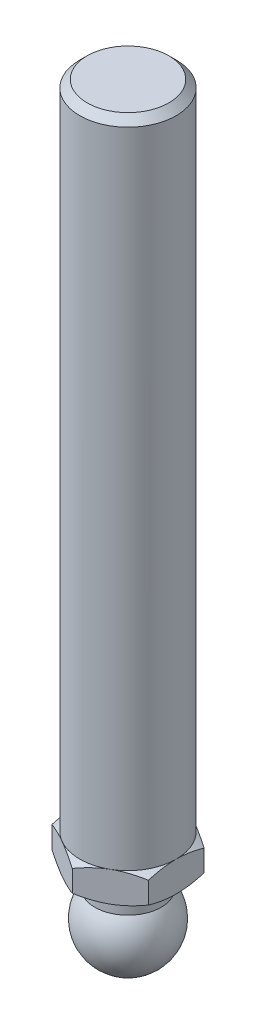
ISO-10303-21;
HEADER;
FILE_DESCRIPTION(('STEP AP214'),'2;1');
FILE_NAME('part.step','',(''),(''),'','','');
FILE_SCHEMA(('AUTOMOTIVE_DESIGN { 1 0 10303 214 1 1 1 1 }'));
ENDSEC;
DATA;
#1=APPLICATION_CONTEXT('core data for automotive mechanical design processes');
#2=APPLICATION_PROTOCOL_DEFINITION('international standard','automotive_design',2000,#1);
#3=PRODUCT_CONTEXT('',#1,'mechanical');
#4=PRODUCT('Part','Part','',(#3));
#5=PRODUCT_RELATED_PRODUCT_CATEGORY('part','',(#4));
#6=PRODUCT_DEFINITION_FORMATION('','',#4);
#7=PRODUCT_DEFINITION_CONTEXT('part definition',#1,'design');
#8=PRODUCT_DEFINITION('design','',#6,#7);
#9=PRODUCT_DEFINITION_SHAPE('','',#8);
#10=(LENGTH_UNIT() NAMED_UNIT(*) SI_UNIT(.MILLI.,.METRE.));
#11=(NAMED_UNIT(*) PLANE_ANGLE_UNIT() SI_UNIT($,.RADIAN.));
#12=(NAMED_UNIT(*) SI_UNIT($,.STERADIAN.) SOLID_ANGLE_UNIT());
#13=UNCERTAINTY_MEASURE_WITH_UNIT(LENGTH_MEASURE(1.E-05),#10,'distance_accuracy_value','');
#14=(GEOMETRIC_REPRESENTATION_CONTEXT(3) GLOBAL_UNCERTAINTY_ASSIGNED_CONTEXT((#13)) GLOBAL_UNIT_ASSIGNED_CONTEXT((#10,
#11,#12)) REPRESENTATION_CONTEXT('',''));
#15=CARTESIAN_POINT('',(0.,0.,0.));
#16=DIRECTION('',(0.,0.,1.));
#17=DIRECTION('',(1.,0.,0.));
#18=AXIS2_PLACEMENT_3D('',#15,#16,#17);
#19=CARTESIAN_POINT('',(0.,7.,0.));
#20=DIRECTION('',(0.,-1.,0.));
#21=DIRECTION('',(-1.,0.,0.));
#22=AXIS2_PLACEMENT_3D('',#19,#20,#21);
#23=SPHERICAL_SURFACE('',#22,7.);
#24=CARTESIAN_POINT('',(-9.71445146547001E-13,0.,0.));
#25=VERTEX_POINT('',#24);
#26=VERTEX_LOOP('',#25);
#27=FACE_BOUND('',#26,.T.);
#28=CARTESIAN_POINT('',(0.,11.3301270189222,0.));
#29=DIRECTION('',(0.,-1.,0.));
#30=DIRECTION('',(0.,0.,-1.));
#31=AXIS2_PLACEMENT_3D('',#28,#29,#30);
#32=CIRCLE('',#31,5.5);
#33=CARTESIAN_POINT('',(0.,11.3301270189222,-5.5));
#34=VERTEX_POINT('',#33);
#35=EDGE_CURVE('E9',#34,#34,#32,.T.);
#36=ORIENTED_EDGE('',*,*,#35,.T.);
#37=EDGE_LOOP('',(#36));
#38=FACE_BOUND('',#37,.T.);
#39=ADVANCED_FACE('F14',(#27,#38),#23,.T.);
#40=CARTESIAN_POINT('',(0.,0.,0.));
#41=DIRECTION('',(0.,-1.,0.));
#42=DIRECTION('',(0.,0.,-1.));
#43=AXIS2_PLACEMENT_3D('',#40,#41,#42);
#44=CYLINDRICAL_SURFACE('',#43,5.5);
#45=ORIENTED_EDGE('',*,*,#35,.F.);
#46=EDGE_LOOP('',(#45));
#47=FACE_BOUND('',#46,.T.);
#48=CARTESIAN_POINT('',(0.,14.5,0.));
#49=DIRECTION('',(0.,-1.,0.));
#50=DIRECTION('',(0.,0.,-1.));
#51=AXIS2_PLACEMENT_3D('',#48,#49,#50);
#52=CIRCLE('',#51,5.5);
#53=CARTESIAN_POINT('',(0.,14.5,-5.5));
#54=VERTEX_POINT('',#53);
#55=EDGE_CURVE('E146',#54,#54,#52,.T.);
#56=ORIENTED_EDGE('',*,*,#55,.T.);
#57=EDGE_LOOP('',(#56));
#58=FACE_BOUND('',#57,.T.);
#59=ADVANCED_FACE('F251',(#47,#58),#44,.T.);
#60=CARTESIAN_POINT('',(8.,14.5,0.));
#61=DIRECTION('',(0.,1.,0.));
#62=DIRECTION('',(0.,0.,1.));
#63=AXIS2_PLACEMENT_3D('',#60,#61,#62);
#64=PLANE('',#63);
#65=ORIENTED_EDGE('',*,*,#55,.F.);
#66=EDGE_LOOP('',(#65));
#67=FACE_BOUND('',#66,.T.);
#68=CARTESIAN_POINT('',(0.,14.5,0.));
#69=DIRECTION('',(0.,-1.,0.));
#70=DIRECTION('',(0.,0.,-1.));
#71=AXIS2_PLACEMENT_3D('',#68,#69,#70);
#72=CIRCLE('',#71,8.);
#73=CARTESIAN_POINT('',(4.,14.5,-6.92820323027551));
#74=VERTEX_POINT('',#73);
#75=CARTESIAN_POINT('',(8.,14.5,0.));
#76=VERTEX_POINT('',#75);
#77=EDGE_CURVE('E145',#74,#76,#72,.T.);
#78=ORIENTED_EDGE('',*,*,#77,.T.);
#79=CARTESIAN_POINT('',(4.,14.5,6.92820323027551));
#80=VERTEX_POINT('',#79);
#81=EDGE_CURVE('E141',#76,#80,#72,.T.);
#82=ORIENTED_EDGE('',*,*,#81,.T.);
#83=CARTESIAN_POINT('',(-4.,14.5,6.92820323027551));
#84=VERTEX_POINT('',#83);
#85=EDGE_CURVE('E144',#80,#84,#72,.T.);
#86=ORIENTED_EDGE('',*,*,#85,.T.);
#87=CARTESIAN_POINT('',(-8.,14.5,0.));
#88=VERTEX_POINT('',#87);
#89=EDGE_CURVE('E212',#84,#88,#72,.T.);
#90=ORIENTED_EDGE('',*,*,#89,.T.);
#91=CARTESIAN_POINT('',(-4.,14.5,-6.92820323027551));
#92=VERTEX_POINT('',#91);
#93=EDGE_CURVE('E215',#88,#92,#72,.T.);
#94=ORIENTED_EDGE('',*,*,#93,.T.);
#95=EDGE_CURVE('E220',#92,#74,#72,.T.);
#96=ORIENTED_EDGE('',*,*,#95,.T.);
#97=EDGE_LOOP('',(#78,#82,#86,#90,#94,#96));
#98=FACE_BOUND('',#97,.T.);
#99=ADVANCED_FACE('F222',(#67,#98),#64,.F.);
#100=CARTESIAN_POINT('',(0.,17.,0.));
#101=DIRECTION('',(0.,1.,0.));
#102=DIRECTION('',(0.,0.,1.));
#103=AXIS2_PLACEMENT_3D('',#100,#101,#102);
#104=CONICAL_SURFACE('',#103,12.3301270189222,1.0471975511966);
#105=CARTESIAN_POINT('',(-8.,19.285548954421,-14.1889203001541));
#106=CARTESIAN_POINT('',(-8.,19.1157216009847,-13.851186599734));
#107=CARTESIAN_POINT('',(-8.,18.9470198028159,-13.5128811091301));
#108=CARTESIAN_POINT('',(-8.,18.6124136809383,-12.8348638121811));
#109=CARTESIAN_POINT('',(-8.,18.446509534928,-12.4951519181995));
#110=CARTESIAN_POINT('',(-8.,18.1177477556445,-11.8134403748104));
#111=CARTESIAN_POINT('',(-8.,17.9548966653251,-11.4714375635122));
#112=CARTESIAN_POINT('',(-8.,17.6333333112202,-10.7854960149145));
#113=CARTESIAN_POINT('',(-8.,17.4746209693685,-10.4415573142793));
#114=CARTESIAN_POINT('',(-8.,17.1550497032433,-9.7353527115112));
#115=CARTESIAN_POINT('',(-8.,16.9944328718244,-9.37297690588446));
#116=CARTESIAN_POINT('',(-8.,16.680226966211,-8.64516064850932));
#117=CARTESIAN_POINT('',(-8.,16.5266382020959,-8.27972006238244));
#118=CARTESIAN_POINT('',(-8.,16.2285062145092,-7.54540420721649));
#119=CARTESIAN_POINT('',(-8.,16.0839575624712,-7.17653115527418));
#120=CARTESIAN_POINT('',(-8.,15.8063691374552,-6.43449862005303));
#121=CARTESIAN_POINT('',(-8.,15.6733281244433,-6.06133960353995));
#122=CARTESIAN_POINT('',(-8.,15.394180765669,-5.22677195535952));
#123=CARTESIAN_POINT('',(-8.,15.2517108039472,-4.7641292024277));
#124=CARTESIAN_POINT('',(-8.,14.9966536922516,-3.83044032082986));
#125=CARTESIAN_POINT('',(-8.,14.884064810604,-3.35939468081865));
#126=CARTESIAN_POINT('',(-8.,14.7453718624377,-2.65118427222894));
#127=CARTESIAN_POINT('',(-8.,14.7044045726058,-2.41690742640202));
#128=CARTESIAN_POINT('',(-8.,14.6329876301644,-1.94676929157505));
#129=CARTESIAN_POINT('',(-8.,14.6025364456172,-1.7109082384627));
#130=CARTESIAN_POINT('',(-8.,14.5530553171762,-1.23805721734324));
#131=CARTESIAN_POINT('',(-8.,14.5340217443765,-1.00106763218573));
#132=CARTESIAN_POINT('',(-8.,14.5079793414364,-0.52642336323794));
#133=CARTESIAN_POINT('',(-8.,14.500970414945,-0.288768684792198));
#134=CARTESIAN_POINT('',(-8.,14.4992116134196,0.188309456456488));
#135=CARTESIAN_POINT('',(-8.,14.5045509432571,0.427733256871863));
#136=CARTESIAN_POINT('',(-8.,14.5274871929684,0.905988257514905));
#137=CARTESIAN_POINT('',(-8.,14.5450842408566,1.1448194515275));
#138=CARTESIAN_POINT('',(-8.,14.5919591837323,1.62141631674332));
#139=CARTESIAN_POINT('',(-8.,14.6212415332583,1.85918154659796));
#140=CARTESIAN_POINT('',(-8.,14.6905925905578,2.33311174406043));
#141=CARTESIAN_POINT('',(-8.,14.7306614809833,2.56927668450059));
#142=CARTESIAN_POINT('',(-8.,14.8670437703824,3.28330816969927));
#143=CARTESIAN_POINT('',(-8.,14.9786420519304,3.75830022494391));
#144=CARTESIAN_POINT('',(-8.,15.169124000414,4.46428489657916));
#145=CARTESIAN_POINT('',(-8.,15.2364734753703,4.69855285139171));
#146=CARTESIAN_POINT('',(-8.,15.3778224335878,5.16507806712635));
#147=CARTESIAN_POINT('',(-8.,15.4518216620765,5.3973354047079));
#148=CARTESIAN_POINT('',(-8.,15.654376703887,6.0070580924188));
#149=CARTESIAN_POINT('',(-8.,15.7876997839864,6.38293491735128));
#150=CARTESIAN_POINT('',(-8.,16.0661205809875,7.13030495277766));
#151=CARTESIAN_POINT('',(-8.,16.2112196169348,7.50179766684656));
#152=CARTESIAN_POINT('',(-8.,16.5106611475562,8.2412884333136));
#153=CARTESIAN_POINT('',(-8.,16.6650093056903,8.60928418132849));
#154=CARTESIAN_POINT('',(-8.,16.9808780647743,9.34215095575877));
#155=CARTESIAN_POINT('',(-8.,17.1423983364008,9.7070221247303));
#156=CARTESIAN_POINT('',(-8.,17.4637771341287,10.4179250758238));
#157=CARTESIAN_POINT('',(-8.,17.6233869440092,10.7640696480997));
#158=CARTESIAN_POINT('',(-8.,17.9468132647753,11.4543922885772));
#159=CARTESIAN_POINT('',(-8.,18.1106298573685,11.7985703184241));
#160=CARTESIAN_POINT('',(-8.,18.441361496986,12.4845836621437));
#161=CARTESIAN_POINT('',(-8.,18.6082696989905,12.8264222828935));
#162=CARTESIAN_POINT('',(-8.,18.9449220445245,13.5086735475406));
#163=CARTESIAN_POINT('',(-8.,19.1146660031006,13.8490862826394));
#164=CARTESIAN_POINT('',(-8.,19.285548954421,14.1889203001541));
#165=B_SPLINE_CURVE_WITH_KNOTS('',3,(#105,#106,#107,#108,#109,#110,#111,#112,#113,#114,#115,
#116,#117,#118,#119,#120,#121,#122,#123,#124,#125,#126,#127,#128,#129,#130,#131,#132,#133,#134,
#135,#136,#137,#138,#139,#140,#141,#142,#143,#144,#145,#146,#147,#148,#149,#150,#151,#152,#153,
#154,#155,#156,#157,#158,#159,#160,#161,#162,#163,#164),.UNSPECIFIED.,.F.,.F.,(4,2,2,2,2,2,2,2,
2,2,2,2,2,2,2,2,2,2,2,2,2,2,2,2,2,2,2,2,2,4),(0.,1.13409047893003,2.2682527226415,
3.40461779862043,4.54096142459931,5.7300307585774,6.91915250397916,8.1075531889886,
9.29582565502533,10.7473798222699,12.1988498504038,12.9121466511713,13.6253394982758,
14.3383055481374,15.0512658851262,15.7693927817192,16.4875271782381,17.2059355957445,
17.9243561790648,19.3864869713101,20.1177019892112,20.8488890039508,22.0450800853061,
23.2414053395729,24.4384707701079,25.6354812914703,26.7789606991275,27.9224623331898,
29.063679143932,30.2048218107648),.UNSPECIFIED.);
#166=CARTESIAN_POINT('',(-8.,15.2145311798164,4.61880215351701));
#167=VERTEX_POINT('',#166);
#168=EDGE_CURVE('E157',#88,#167,#165,.T.);
#169=ORIENTED_EDGE('',*,*,#168,.F.);
#170=ORIENTED_EDGE('',*,*,#89,.F.);
#171=CARTESIAN_POINT('',(-8.0002,15.214597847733,4.61868668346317));
#172=CARTESIAN_POINT('',(-7.82435121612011,15.1559907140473,4.7202130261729));
#173=CARTESIAN_POINT('',(-7.64784680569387,15.1000434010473,4.82211789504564));
#174=CARTESIAN_POINT('',(-7.29340453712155,14.9942010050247,5.02675523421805));
#175=CARTESIAN_POINT('',(-7.11546609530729,14.9443085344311,5.1294880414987));
#176=CARTESIAN_POINT('',(-6.57880176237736,14.8046927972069,5.43933133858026));
#177=CARTESIAN_POINT('',(-6.21795741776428,14.7252811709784,5.64766491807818));
#178=CARTESIAN_POINT('',(-5.67796082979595,14.6321616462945,5.95943209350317));
#179=CARTESIAN_POINT('',(-5.50042181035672,14.6056345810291,6.06193429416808));
#180=CARTESIAN_POINT('',(-5.1445408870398,14.5611531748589,6.26740224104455));
#181=CARTESIAN_POINT('',(-4.96619905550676,14.5431980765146,6.37036794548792));
#182=CARTESIAN_POINT('',(-4.60920831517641,14.5163156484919,6.57647664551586));
#183=CARTESIAN_POINT('',(-4.4305599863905,14.5073780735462,6.67961930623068));
#184=CARTESIAN_POINT('',(-4.07309829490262,14.4987223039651,6.88599991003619));
#185=CARTESIAN_POINT('',(-3.89428493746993,14.4990038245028,6.98923785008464));
#186=CARTESIAN_POINT('',(-3.55998663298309,14.5081450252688,7.18224506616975));
#187=CARTESIAN_POINT('',(-3.40447809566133,14.5158896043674,7.27202796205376));
#188=CARTESIAN_POINT('',(-3.09382523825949,14.5382011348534,7.45138347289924));
#189=CARTESIAN_POINT('',(-2.93868094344,14.5527685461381,7.54095607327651));
#190=CARTESIAN_POINT('',(-2.47384868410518,14.6063606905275,7.80932710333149));
#191=CARTESIAN_POINT('',(-2.16498351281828,14.6552686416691,7.98765049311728));
#192=CARTESIAN_POINT('',(-1.5439767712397,14.7775394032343,8.34618890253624));
#193=CARTESIAN_POINT('',(-1.23191445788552,14.851420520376,8.52635816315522));
#194=CARTESIAN_POINT('',(-0.612443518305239,15.019100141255,8.88400987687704));
#195=CARTESIAN_POINT('',(-0.305026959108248,15.1128592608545,9.06149691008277));
#196=CARTESIAN_POINT('',(0.000200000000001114,15.214597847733,9.23771977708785));
#197=B_SPLINE_CURVE_WITH_KNOTS('',3,(#171,#172,#173,#174,#175,#176,#177,#178,#179,#180,#181,
#182,#183,#184,#185,#186,#187,#188,#189,#190,#191,#192,#193,#194,#195,#196),.UNSPECIFIED.,.F.,
.F.,(4,2,2,2,2,2,2,2,2,2,2,2,4),(0.,0.633973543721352,1.26821965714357,2.53934712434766,
3.1593434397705,3.77928496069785,4.39852133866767,5.01773858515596,5.5568023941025,
6.09590254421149,7.17487077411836,8.27776850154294,9.37850115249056),.UNSPECIFIED.);
#198=EDGE_CURVE('E120',#167,#84,#197,.T.);
#199=ORIENTED_EDGE('',*,*,#198,.F.);
#200=EDGE_LOOP('',(#169,#170,#199));
#201=FACE_BOUND('',#200,.T.);
#202=ADVANCED_FACE('F210',(#201),#104,.T.);
#203=CARTESIAN_POINT('',(0.0002,15.214597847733,-9.23771977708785));
#204=CARTESIAN_POINT('',(-0.175648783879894,15.1559907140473,-9.13619343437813));
#205=CARTESIAN_POINT('',(-0.352153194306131,15.1000434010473,-9.03428856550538));
#206=CARTESIAN_POINT('',(-0.706595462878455,14.9942010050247,-8.82965122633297));
#207=CARTESIAN_POINT('',(-0.884533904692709,14.9443085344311,-8.72691841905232));
#208=CARTESIAN_POINT('',(-1.42119823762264,14.8046927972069,-8.41707512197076));
#209=CARTESIAN_POINT('',(-1.78204258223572,14.7252811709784,-8.20874154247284));
#210=CARTESIAN_POINT('',(-2.32203917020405,14.6321616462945,-7.89697436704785));
#211=CARTESIAN_POINT('',(-2.49957818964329,14.6056345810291,-7.79447216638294));
#212=CARTESIAN_POINT('',(-2.8554591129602,14.5611531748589,-7.58900421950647));
#213=CARTESIAN_POINT('',(-3.03380094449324,14.5431980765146,-7.4860385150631));
#214=CARTESIAN_POINT('',(-3.39079168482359,14.5163156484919,-7.27992981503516));
#215=CARTESIAN_POINT('',(-3.5694400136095,14.5073780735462,-7.17678715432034));
#216=CARTESIAN_POINT('',(-3.92690170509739,14.4987223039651,-6.97040655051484));
#217=CARTESIAN_POINT('',(-4.10571506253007,14.4990038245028,-6.86716861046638));
#218=CARTESIAN_POINT('',(-4.44001336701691,14.5081450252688,-6.67416139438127));
#219=CARTESIAN_POINT('',(-4.59552190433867,14.5158896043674,-6.58437849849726));
#220=CARTESIAN_POINT('',(-4.90617476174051,14.5382011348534,-6.40502298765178));
#221=CARTESIAN_POINT('',(-5.06131905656,14.5527685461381,-6.31545038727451));
#222=CARTESIAN_POINT('',(-5.52615131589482,14.6063606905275,-6.04707935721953));
#223=CARTESIAN_POINT('',(-5.83501648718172,14.6552686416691,-5.86875596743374));
#224=CARTESIAN_POINT('',(-6.4560232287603,14.7775394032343,-5.51021755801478));
#225=CARTESIAN_POINT('',(-6.76808554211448,14.851420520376,-5.3300482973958));
#226=CARTESIAN_POINT('',(-7.38755648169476,15.019100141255,-4.97239658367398));
#227=CARTESIAN_POINT('',(-7.69497304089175,15.1128592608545,-4.79490955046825));
#228=CARTESIAN_POINT('',(-8.0002,15.214597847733,-4.61868668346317));
#229=B_SPLINE_CURVE_WITH_KNOTS('',3,(#203,#204,#205,#206,#207,#208,#209,#210,#211,#212,#213,
#214,#215,#216,#217,#218,#219,#220,#221,#222,#223,#224,#225,#226,#227,#228),.UNSPECIFIED.,.F.,
.F.,(4,2,2,2,2,2,2,2,2,2,2,2,4),(0.,0.633973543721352,1.26821965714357,2.53934712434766,
3.1593434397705,3.77928496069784,4.39852133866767,5.01773858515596,5.5568023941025,
6.09590254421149,7.17487077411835,8.27776850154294,9.37850115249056),.UNSPECIFIED.);
#230=CARTESIAN_POINT('',(-8.,15.2145311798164,-4.61880215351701));
#231=VERTEX_POINT('',#230);
#232=EDGE_CURVE('E182',#92,#231,#229,.T.);
#233=ORIENTED_EDGE('',*,*,#232,.F.);
#234=ORIENTED_EDGE('',*,*,#93,.F.);
#235=EDGE_CURVE('E156',#231,#88,#165,.T.);
#236=ORIENTED_EDGE('',*,*,#235,.F.);
#237=EDGE_LOOP('',(#233,#234,#236));
#238=FACE_BOUND('',#237,.T.);
#239=ADVANCED_FACE('F216',(#238),#104,.T.);
#240=CARTESIAN_POINT('',(8.0002,15.214597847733,-4.61868668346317));
#241=CARTESIAN_POINT('',(7.82435121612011,15.1559907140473,-4.7202130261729));
#242=CARTESIAN_POINT('',(7.64784680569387,15.1000434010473,-4.82211789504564));
#243=CARTESIAN_POINT('',(7.29340453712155,14.9942010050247,-5.02675523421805));
#244=CARTESIAN_POINT('',(7.11546609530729,14.9443085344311,-5.1294880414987));
#245=CARTESIAN_POINT('',(6.57880176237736,14.8046927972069,-5.43933133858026));
#246=CARTESIAN_POINT('',(6.21795741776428,14.7252811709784,-5.64766491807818));
#247=CARTESIAN_POINT('',(5.67796082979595,14.6321616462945,-5.95943209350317));
#248=CARTESIAN_POINT('',(5.50042181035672,14.6056345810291,-6.06193429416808));
#249=CARTESIAN_POINT('',(5.1445408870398,14.5611531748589,-6.26740224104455));
#250=CARTESIAN_POINT('',(4.96619905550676,14.5431980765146,-6.37036794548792));
#251=CARTESIAN_POINT('',(4.60920831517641,14.5163156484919,-6.57647664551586));
#252=CARTESIAN_POINT('',(4.4305599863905,14.5073780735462,-6.67961930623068));
#253=CARTESIAN_POINT('',(4.07309829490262,14.4987223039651,-6.88599991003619));
#254=CARTESIAN_POINT('',(3.89428493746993,14.4990038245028,-6.98923785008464));
#255=CARTESIAN_POINT('',(3.55998663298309,14.5081450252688,-7.18224506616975));
#256=CARTESIAN_POINT('',(3.40447809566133,14.5158896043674,-7.27202796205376));
#257=CARTESIAN_POINT('',(3.09382523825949,14.5382011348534,-7.45138347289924));
#258=CARTESIAN_POINT('',(2.93868094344,14.5527685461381,-7.54095607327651));
#259=CARTESIAN_POINT('',(2.47384868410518,14.6063606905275,-7.80932710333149));
#260=CARTESIAN_POINT('',(2.16498351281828,14.6552686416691,-7.98765049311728));
#261=CARTESIAN_POINT('',(1.5439767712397,14.7775394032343,-8.34618890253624));
#262=CARTESIAN_POINT('',(1.23191445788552,14.851420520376,-8.52635816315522));
#263=CARTESIAN_POINT('',(0.612443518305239,15.019100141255,-8.88400987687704));
#264=CARTESIAN_POINT('',(0.305026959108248,15.1128592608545,-9.06149691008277));
#265=CARTESIAN_POINT('',(-0.000200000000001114,15.214597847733,-9.23771977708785));
#266=B_SPLINE_CURVE_WITH_KNOTS('',3,(#240,#241,#242,#243,#244,#245,#246,#247,#248,#249,#250,
#251,#252,#253,#254,#255,#256,#257,#258,#259,#260,#261,#262,#263,#264,#265),.UNSPECIFIED.,.F.,
.F.,(4,2,2,2,2,2,2,2,2,2,2,2,4),(0.,0.633973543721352,1.26821965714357,2.53934712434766,
3.1593434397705,3.77928496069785,4.39852133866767,5.01773858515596,5.5568023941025,
6.09590254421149,7.17487077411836,8.27776850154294,9.37850115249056),.UNSPECIFIED.);
#267=CARTESIAN_POINT('',(0.,15.2145311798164,-9.23760430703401));
#268=VERTEX_POINT('',#267);
#269=EDGE_CURVE('E285',#74,#268,#266,.T.);
#270=ORIENTED_EDGE('',*,*,#269,.F.);
#271=ORIENTED_EDGE('',*,*,#95,.F.);
#272=EDGE_CURVE('E193',#268,#92,#229,.T.);
#273=ORIENTED_EDGE('',*,*,#272,.F.);
#274=EDGE_LOOP('',(#270,#271,#273));
#275=FACE_BOUND('',#274,.T.);
#276=ADVANCED_FACE('F305',(#275),#104,.T.);
#277=CARTESIAN_POINT('',(-0.0002,15.214597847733,9.23771977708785));
#278=CARTESIAN_POINT('',(0.175648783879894,15.1559907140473,9.13619343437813));
#279=CARTESIAN_POINT('',(0.352153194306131,15.1000434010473,9.03428856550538));
#280=CARTESIAN_POINT('',(0.706595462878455,14.9942010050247,8.82965122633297));
#281=CARTESIAN_POINT('',(0.884533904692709,14.9443085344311,8.72691841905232));
#282=CARTESIAN_POINT('',(1.42119823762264,14.8046927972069,8.41707512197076));
#283=CARTESIAN_POINT('',(1.78204258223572,14.7252811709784,8.20874154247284));
#284=CARTESIAN_POINT('',(2.32203917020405,14.6321616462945,7.89697436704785));
#285=CARTESIAN_POINT('',(2.49957818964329,14.6056345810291,7.79447216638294));
#286=CARTESIAN_POINT('',(2.8554591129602,14.5611531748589,7.58900421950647));
#287=CARTESIAN_POINT('',(3.03380094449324,14.5431980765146,7.4860385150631));
#288=CARTESIAN_POINT('',(3.39079168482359,14.5163156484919,7.27992981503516));
#289=CARTESIAN_POINT('',(3.5694400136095,14.5073780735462,7.17678715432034));
#290=CARTESIAN_POINT('',(3.92690170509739,14.4987223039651,6.97040655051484));
#291=CARTESIAN_POINT('',(4.10571506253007,14.4990038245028,6.86716861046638));
#292=CARTESIAN_POINT('',(4.44001336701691,14.5081450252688,6.67416139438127));
#293=CARTESIAN_POINT('',(4.59552190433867,14.5158896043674,6.58437849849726));
#294=CARTESIAN_POINT('',(4.90617476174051,14.5382011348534,6.40502298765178));
#295=CARTESIAN_POINT('',(5.06131905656,14.5527685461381,6.31545038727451));
#296=CARTESIAN_POINT('',(5.52615131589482,14.6063606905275,6.04707935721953));
#297=CARTESIAN_POINT('',(5.83501648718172,14.6552686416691,5.86875596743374));
#298=CARTESIAN_POINT('',(6.4560232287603,14.7775394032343,5.51021755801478));
#299=CARTESIAN_POINT('',(6.76808554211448,14.851420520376,5.3300482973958));
#300=CARTESIAN_POINT('',(7.38755648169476,15.019100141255,4.97239658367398));
#301=CARTESIAN_POINT('',(7.69497304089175,15.1128592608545,4.79490955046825));
#302=CARTESIAN_POINT('',(8.0002,15.214597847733,4.61868668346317));
#303=B_SPLINE_CURVE_WITH_KNOTS('',3,(#277,#278,#279,#280,#281,#282,#283,#284,#285,#286,#287,
#288,#289,#290,#291,#292,#293,#294,#295,#296,#297,#298,#299,#300,#301,#302),.UNSPECIFIED.,.F.,
.F.,(4,2,2,2,2,2,2,2,2,2,2,2,4),(0.,0.633973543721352,1.26821965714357,2.53934712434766,
3.1593434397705,3.77928496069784,4.39852133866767,5.01773858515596,5.5568023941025,
6.09590254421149,7.17487077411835,8.27776850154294,9.37850115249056),.UNSPECIFIED.);
#304=CARTESIAN_POINT('',(0.,15.2145311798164,9.23760430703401));
#305=VERTEX_POINT('',#304);
#306=EDGE_CURVE('E228',#305,#80,#303,.T.);
#307=ORIENTED_EDGE('',*,*,#306,.F.);
#308=EDGE_CURVE('E31',#84,#305,#197,.T.);
#309=ORIENTED_EDGE('',*,*,#308,.F.);
#310=ORIENTED_EDGE('',*,*,#85,.F.);
#311=EDGE_LOOP('',(#307,#309,#310));
#312=FACE_BOUND('',#311,.T.);
#313=ADVANCED_FACE('F227',(#312),#104,.T.);
#314=CARTESIAN_POINT('',(8.,15.2145311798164,-4.61880215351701));
#315=VERTEX_POINT('',#314);
#316=EDGE_CURVE('E290',#315,#74,#266,.T.);
#317=ORIENTED_EDGE('',*,*,#316,.F.);
#318=CARTESIAN_POINT('',(8.,19.285548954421,14.1889203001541));
#319=CARTESIAN_POINT('',(8.,19.1157216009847,13.851186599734));
#320=CARTESIAN_POINT('',(8.,18.9470198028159,13.5128811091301));
#321=CARTESIAN_POINT('',(8.,18.6124136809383,12.8348638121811));
#322=CARTESIAN_POINT('',(8.,18.446509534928,12.4951519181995));
#323=CARTESIAN_POINT('',(8.,18.1177477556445,11.8134403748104));
#324=CARTESIAN_POINT('',(8.,17.9548966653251,11.4714375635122));
#325=CARTESIAN_POINT('',(8.,17.6333333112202,10.7854960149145));
#326=CARTESIAN_POINT('',(8.,17.4746209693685,10.4415573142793));
#327=CARTESIAN_POINT('',(8.,17.1550497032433,9.7353527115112));
#328=CARTESIAN_POINT('',(8.,16.9944328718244,9.37297690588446));
#329=CARTESIAN_POINT('',(8.,16.680226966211,8.64516064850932));
#330=CARTESIAN_POINT('',(8.,16.5266382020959,8.27972006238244));
#331=CARTESIAN_POINT('',(8.,16.2285062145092,7.54540420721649));
#332=CARTESIAN_POINT('',(8.,16.0839575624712,7.17653115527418));
#333=CARTESIAN_POINT('',(8.,15.8063691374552,6.43449862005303));
#334=CARTESIAN_POINT('',(8.,15.6733281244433,6.06133960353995));
#335=CARTESIAN_POINT('',(8.,15.394180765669,5.22677195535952));
#336=CARTESIAN_POINT('',(8.,15.2517108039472,4.7641292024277));
#337=CARTESIAN_POINT('',(8.,14.9966536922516,3.83044032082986));
#338=CARTESIAN_POINT('',(8.,14.884064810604,3.35939468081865));
#339=CARTESIAN_POINT('',(8.,14.7453718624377,2.65118427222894));
#340=CARTESIAN_POINT('',(8.,14.7044045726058,2.41690742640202));
#341=CARTESIAN_POINT('',(8.,14.6329876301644,1.94676929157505));
#342=CARTESIAN_POINT('',(8.,14.6025364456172,1.7109082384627));
#343=CARTESIAN_POINT('',(8.,14.5530553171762,1.23805721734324));
#344=CARTESIAN_POINT('',(8.,14.5340217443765,1.00106763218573));
#345=CARTESIAN_POINT('',(8.,14.5079793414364,0.52642336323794));
#346=CARTESIAN_POINT('',(8.,14.500970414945,0.288768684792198));
#347=CARTESIAN_POINT('',(8.,14.4992116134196,-0.188309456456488));
#348=CARTESIAN_POINT('',(8.,14.5045509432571,-0.427733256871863));
#349=CARTESIAN_POINT('',(8.,14.5274871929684,-0.905988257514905));
#350=CARTESIAN_POINT('',(8.,14.5450842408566,-1.1448194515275));
#351=CARTESIAN_POINT('',(8.,14.5919591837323,-1.62141631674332));
#352=CARTESIAN_POINT('',(8.,14.6212415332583,-1.85918154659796));
#353=CARTESIAN_POINT('',(8.,14.6905925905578,-2.33311174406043));
#354=CARTESIAN_POINT('',(8.,14.7306614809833,-2.56927668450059));
#355=CARTESIAN_POINT('',(8.,14.8670437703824,-3.28330816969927));
#356=CARTESIAN_POINT('',(8.,14.9786420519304,-3.75830022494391));
#357=CARTESIAN_POINT('',(8.,15.169124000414,-4.46428489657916));
#358=CARTESIAN_POINT('',(8.,15.2364734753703,-4.69855285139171));
#359=CARTESIAN_POINT('',(8.,15.3778224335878,-5.16507806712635));
#360=CARTESIAN_POINT('',(8.,15.4518216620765,-5.3973354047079));
#361=CARTESIAN_POINT('',(8.,15.654376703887,-6.0070580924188));
#362=CARTESIAN_POINT('',(8.,15.7876997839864,-6.38293491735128));
#363=CARTESIAN_POINT('',(8.,16.0661205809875,-7.13030495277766));
#364=CARTESIAN_POINT('',(8.,16.2112196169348,-7.50179766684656));
#365=CARTESIAN_POINT('',(8.,16.5106611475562,-8.2412884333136));
#366=CARTESIAN_POINT('',(8.,16.6650093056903,-8.60928418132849));
#367=CARTESIAN_POINT('',(8.,16.9808780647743,-9.34215095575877));
#368=CARTESIAN_POINT('',(8.,17.1423983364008,-9.7070221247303));
#369=CARTESIAN_POINT('',(8.,17.4637771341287,-10.4179250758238));
#370=CARTESIAN_POINT('',(8.,17.6233869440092,-10.7640696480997));
#371=CARTESIAN_POINT('',(8.,17.9468132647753,-11.4543922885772));
#372=CARTESIAN_POINT('',(8.,18.1106298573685,-11.7985703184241));
#373=CARTESIAN_POINT('',(8.,18.441361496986,-12.4845836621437));
#374=CARTESIAN_POINT('',(8.,18.6082696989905,-12.8264222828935));
#375=CARTESIAN_POINT('',(8.,18.9449220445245,-13.5086735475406));
#376=CARTESIAN_POINT('',(8.,19.1146660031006,-13.8490862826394));
#377=CARTESIAN_POINT('',(8.,19.285548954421,-14.1889203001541));
#378=B_SPLINE_CURVE_WITH_KNOTS('',3,(#318,#319,#320,#321,#322,#323,#324,#325,#326,#327,#328,
#329,#330,#331,#332,#333,#334,#335,#336,#337,#338,#339,#340,#341,#342,#343,#344,#345,#346,#347,
#348,#349,#350,#351,#352,#353,#354,#355,#356,#357,#358,#359,#360,#361,#362,#363,#364,#365,#366,
#367,#368,#369,#370,#371,#372,#373,#374,#375,#376,#377),.UNSPECIFIED.,.F.,.F.,(4,2,2,2,2,2,2,2,
2,2,2,2,2,2,2,2,2,2,2,2,2,2,2,2,2,2,2,2,2,4),(0.,1.13409047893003,2.2682527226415,
3.40461779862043,4.54096142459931,5.7300307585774,6.91915250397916,8.1075531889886,
9.29582565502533,10.7473798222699,12.1988498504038,12.9121466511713,13.6253394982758,
14.3383055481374,15.0512658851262,15.7693927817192,16.4875271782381,17.2059355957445,
17.9243561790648,19.3864869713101,20.1177019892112,20.8488890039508,22.0450800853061,
23.2414053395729,24.4384707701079,25.6354812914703,26.7789606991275,27.9224623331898,
29.063679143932,30.2048218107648),.UNSPECIFIED.);
#379=EDGE_CURVE('E271',#76,#315,#378,.T.);
#380=ORIENTED_EDGE('',*,*,#379,.F.);
#381=ORIENTED_EDGE('',*,*,#77,.F.);
#382=EDGE_LOOP('',(#317,#380,#381));
#383=FACE_BOUND('',#382,.T.);
#384=ADVANCED_FACE('F243',(#383),#104,.T.);
#385=CARTESIAN_POINT('',(8.,15.2145311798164,4.61880215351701));
#386=VERTEX_POINT('',#385);
#387=EDGE_CURVE('E277',#386,#76,#378,.T.);
#388=ORIENTED_EDGE('',*,*,#387,.F.);
#389=EDGE_CURVE('E111',#80,#386,#303,.T.);
#390=ORIENTED_EDGE('',*,*,#389,.F.);
#391=ORIENTED_EDGE('',*,*,#81,.F.);
#392=EDGE_LOOP('',(#388,#390,#391));
#393=FACE_BOUND('',#392,.T.);
#394=ADVANCED_FACE('F250',(#393),#104,.T.);
#395=CARTESIAN_POINT('',(-8.,14.3,4.61880215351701));
#396=DIRECTION('',(-0.5,0.,0.866025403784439));
#397=DIRECTION('',(0.866025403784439,0.,0.5));
#398=AXIS2_PLACEMENT_3D('',#395,#396,#397);
#399=PLANE('',#398);
#400=CARTESIAN_POINT('',(0.0002,18.7854021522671,9.23771977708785));
#401=CARTESIAN_POINT('',(-0.175648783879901,18.8440092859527,9.13619343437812));
#402=CARTESIAN_POINT('',(-0.352153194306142,18.8999565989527,9.03428856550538));
#403=CARTESIAN_POINT('',(-0.706595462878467,19.0057989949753,8.82965122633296));
#404=CARTESIAN_POINT('',(-0.884533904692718,19.0556914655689,8.72691841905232));
#405=CARTESIAN_POINT('',(-1.42119823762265,19.1953072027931,8.41707512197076));
#406=CARTESIAN_POINT('',(-1.78204258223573,19.2747188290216,8.20874154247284));
#407=CARTESIAN_POINT('',(-2.32203917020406,19.3678383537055,7.89697436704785));
#408=CARTESIAN_POINT('',(-2.49957818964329,19.3943654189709,7.79447216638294));
#409=CARTESIAN_POINT('',(-2.85545911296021,19.4388468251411,7.58900421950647));
#410=CARTESIAN_POINT('',(-3.03380094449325,19.4568019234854,7.4860385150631));
#411=CARTESIAN_POINT('',(-3.3907916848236,19.4836843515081,7.27992981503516));
#412=CARTESIAN_POINT('',(-3.56944001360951,19.4926219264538,7.17678715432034));
#413=CARTESIAN_POINT('',(-3.92690170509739,19.5012776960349,6.97040655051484));
#414=CARTESIAN_POINT('',(-4.10571506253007,19.5009961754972,6.86716861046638));
#415=CARTESIAN_POINT('',(-4.44001336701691,19.4918549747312,6.67416139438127));
#416=CARTESIAN_POINT('',(-4.59552190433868,19.4841103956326,6.58437849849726));
#417=CARTESIAN_POINT('',(-4.90617476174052,19.4617988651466,6.40502298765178));
#418=CARTESIAN_POINT('',(-5.06131905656,19.4472314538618,6.31545038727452));
#419=CARTESIAN_POINT('',(-5.52615131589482,19.3936393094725,6.04707935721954));
#420=CARTESIAN_POINT('',(-5.83501648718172,19.3447313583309,5.86875596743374));
#421=CARTESIAN_POINT('',(-6.4560232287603,19.2224605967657,5.51021755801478));
#422=CARTESIAN_POINT('',(-6.76808554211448,19.148579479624,5.33004829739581));
#423=CARTESIAN_POINT('',(-7.38755648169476,18.980899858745,4.97239658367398));
#424=CARTESIAN_POINT('',(-7.69497304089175,18.8871407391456,4.79490955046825));
#425=CARTESIAN_POINT('',(-8.0002,18.7854021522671,4.61868668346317));
#426=B_SPLINE_CURVE_WITH_KNOTS('',3,(#400,#401,#402,#403,#404,#405,#406,#407,#408,#409,#410,
#411,#412,#413,#414,#415,#416,#417,#418,#419,#420,#421,#422,#423,#424,#425),.UNSPECIFIED.,.F.,
.F.,(4,2,2,2,2,2,2,2,2,2,2,2,4),(0.,0.633973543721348,1.26821965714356,2.53934712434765,
3.15934343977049,3.77928496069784,4.39852133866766,5.01773858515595,5.55680239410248,
6.09590254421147,7.17487077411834,8.27776850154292,9.37850115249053),.UNSPECIFIED.);
#427=CARTESIAN_POINT('',(0.,18.7854688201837,9.23760430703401));
#428=VERTEX_POINT('',#427);
#429=CARTESIAN_POINT('',(-4.,19.5,6.92820323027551));
#430=VERTEX_POINT('',#429);
#431=EDGE_CURVE('E101',#428,#430,#426,.T.);
#432=ORIENTED_EDGE('',*,*,#431,.T.);
#433=CARTESIAN_POINT('',(-8.,18.7854688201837,4.61880215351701));
#434=VERTEX_POINT('',#433);
#435=EDGE_CURVE('E105',#430,#434,#426,.T.);
#436=ORIENTED_EDGE('',*,*,#435,.T.);
#437=DIRECTION('',(0.,1.,0.));
#438=VECTOR('',#437,1.);
#439=CARTESIAN_POINT('',(-8.,14.3,4.61880215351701));
#440=LINE('',#439,#438);
#441=EDGE_CURVE('E21',#167,#434,#440,.T.);
#442=ORIENTED_EDGE('',*,*,#441,.F.);
#443=ORIENTED_EDGE('',*,*,#198,.T.);
#444=ORIENTED_EDGE('',*,*,#308,.T.);
#445=DIRECTION('',(0.,1.,0.));
#446=VECTOR('',#445,1.);
#447=CARTESIAN_POINT('',(0.,14.3,9.23760430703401));
#448=LINE('',#447,#446);
#449=EDGE_CURVE('E107',#305,#428,#448,.T.);
#450=ORIENTED_EDGE('',*,*,#449,.T.);
#451=EDGE_LOOP('',(#432,#436,#442,#443,#444,#450));
#452=FACE_BOUND('',#451,.T.);
#453=ADVANCED_FACE('F103',(#452),#399,.T.);
#454=CARTESIAN_POINT('',(-8.,14.3,-4.61880215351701));
#455=DIRECTION('',(-1.,0.,0.));
#456=DIRECTION('',(0.,0.,1.));
#457=AXIS2_PLACEMENT_3D('',#454,#455,#456);
#458=PLANE('',#457);
#459=CARTESIAN_POINT('',(-8.,14.714451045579,14.1889203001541));
#460=CARTESIAN_POINT('',(-8.,14.8842783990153,13.851186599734));
#461=CARTESIAN_POINT('',(-8.,15.0529801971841,13.5128811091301));
#462=CARTESIAN_POINT('',(-8.,15.3875863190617,12.8348638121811));
#463=CARTESIAN_POINT('',(-8.,15.553490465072,12.4951519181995));
#464=CARTESIAN_POINT('',(-8.,15.8822522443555,11.8134403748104));
#465=CARTESIAN_POINT('',(-8.,16.0451033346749,11.4714375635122));
#466=CARTESIAN_POINT('',(-8.,16.3666666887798,10.7854960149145));
#467=CARTESIAN_POINT('',(-8.,16.5253790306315,10.4415573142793));
#468=CARTESIAN_POINT('',(-8.,16.8449502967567,9.73535271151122));
#469=CARTESIAN_POINT('',(-8.,17.0055671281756,9.37297690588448));
#470=CARTESIAN_POINT('',(-8.,17.3197730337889,8.64516064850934));
#471=CARTESIAN_POINT('',(-8.,17.4733617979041,8.27972006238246));
#472=CARTESIAN_POINT('',(-8.,17.7714937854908,7.54540420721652));
#473=CARTESIAN_POINT('',(-8.,17.9160424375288,7.1765311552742));
#474=CARTESIAN_POINT('',(-8.,18.1936308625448,6.43449862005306));
#475=CARTESIAN_POINT('',(-8.,18.3266718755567,6.06133960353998));
#476=CARTESIAN_POINT('',(-8.,18.605819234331,5.22677195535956));
#477=CARTESIAN_POINT('',(-8.,18.7482891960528,4.76412920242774));
#478=CARTESIAN_POINT('',(-8.,19.0033463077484,3.83044032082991));
#479=CARTESIAN_POINT('',(-8.,19.115935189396,3.3593946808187));
#480=CARTESIAN_POINT('',(-8.,19.2546281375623,2.651184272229));
#481=CARTESIAN_POINT('',(-8.,19.2955954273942,2.41690742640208));
#482=CARTESIAN_POINT('',(-8.,19.3670123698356,1.94676929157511));
#483=CARTESIAN_POINT('',(-8.,19.3974635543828,1.71090823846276));
#484=CARTESIAN_POINT('',(-8.,19.4469446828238,1.23805721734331));
#485=CARTESIAN_POINT('',(-8.,19.4659782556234,1.0010676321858));
#486=CARTESIAN_POINT('',(-8.,19.4920206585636,0.526423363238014));
#487=CARTESIAN_POINT('',(-8.,19.499029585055,0.288768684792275));
#488=CARTESIAN_POINT('',(-8.,19.5007883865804,-0.188309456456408));
#489=CARTESIAN_POINT('',(-8.,19.4954490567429,-0.427733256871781));
#490=CARTESIAN_POINT('',(-8.,19.4725128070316,-0.905988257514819));
#491=CARTESIAN_POINT('',(-8.,19.4549157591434,-1.14481945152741));
#492=CARTESIAN_POINT('',(-8.,19.4080408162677,-1.62141631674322));
#493=CARTESIAN_POINT('',(-8.,19.3787584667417,-1.85918154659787));
#494=CARTESIAN_POINT('',(-8.,19.3094074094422,-2.33311174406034));
#495=CARTESIAN_POINT('',(-8.,19.2693385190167,-2.56927668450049));
#496=CARTESIAN_POINT('',(-8.,19.1329562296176,-3.28330816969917));
#497=CARTESIAN_POINT('',(-8.,19.0213579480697,-3.75830022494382));
#498=CARTESIAN_POINT('',(-8.,18.830875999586,-4.46428489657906));
#499=CARTESIAN_POINT('',(-8.,18.7635265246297,-4.69855285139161));
#500=CARTESIAN_POINT('',(-8.,18.6221775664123,-5.16507806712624));
#501=CARTESIAN_POINT('',(-8.,18.5481783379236,-5.39733540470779));
#502=CARTESIAN_POINT('',(-8.,18.3456232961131,-6.00705809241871));
#503=CARTESIAN_POINT('',(-8.,18.2123002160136,-6.38293491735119));
#504=CARTESIAN_POINT('',(-8.,17.9338794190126,-7.13030495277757));
#505=CARTESIAN_POINT('',(-8.,17.7887803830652,-7.50179766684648));
#506=CARTESIAN_POINT('',(-8.,17.4893388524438,-8.24128843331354));
#507=CARTESIAN_POINT('',(-8.,17.3349906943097,-8.60928418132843));
#508=CARTESIAN_POINT('',(-8.,17.0191219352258,-9.34215095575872));
#509=CARTESIAN_POINT('',(-8.,16.8576016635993,-9.70702212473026));
#510=CARTESIAN_POINT('',(-8.,16.5362228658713,-10.4179250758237));
#511=CARTESIAN_POINT('',(-8.,16.3766130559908,-10.7640696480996));
#512=CARTESIAN_POINT('',(-8.,16.0531867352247,-11.4543922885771));
#513=CARTESIAN_POINT('',(-8.,15.8893701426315,-11.798570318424));
#514=CARTESIAN_POINT('',(-8.,15.558638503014,-12.4845836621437));
#515=CARTESIAN_POINT('',(-8.,15.3917303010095,-12.8264222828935));
#516=CARTESIAN_POINT('',(-8.,15.0550779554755,-13.5086735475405));
#517=CARTESIAN_POINT('',(-8.,14.8853339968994,-13.8490862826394));
#518=CARTESIAN_POINT('',(-8.,14.714451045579,-14.1889203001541));
#519=B_SPLINE_CURVE_WITH_KNOTS('',3,(#459,#460,#461,#462,#463,#464,#465,#466,#467,#468,#469,
#470,#471,#472,#473,#474,#475,#476,#477,#478,#479,#480,#481,#482,#483,#484,#485,#486,#487,#488,
#489,#490,#491,#492,#493,#494,#495,#496,#497,#498,#499,#500,#501,#502,#503,#504,#505,#506,#507,
#508,#509,#510,#511,#512,#513,#514,#515,#516,#517,#518),.UNSPECIFIED.,.F.,.F.,(4,2,2,2,2,2,2,2,
2,2,2,2,2,2,2,2,2,2,2,2,2,2,2,2,2,2,2,2,2,4),(0.,1.13409047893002,2.26825272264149,
3.40461779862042,4.5409614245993,5.73003075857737,6.91915250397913,8.10755318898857,
9.29582565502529,10.7473798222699,12.1988498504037,12.9121466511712,13.6253394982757,
14.3383055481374,15.0512658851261,15.7693927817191,16.487527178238,17.2059355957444,
17.9243561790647,19.38648697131,20.1177019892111,20.8488890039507,22.0450800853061,
23.2414053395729,24.4384707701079,25.6354812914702,26.7789606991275,27.9224623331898,
29.063679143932,30.2048218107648),.UNSPECIFIED.);
#520=CARTESIAN_POINT('',(-8.,19.5,0.));
#521=VERTEX_POINT('',#520);
#522=EDGE_CURVE('E119',#434,#521,#519,.T.);
#523=ORIENTED_EDGE('',*,*,#522,.T.);
#524=CARTESIAN_POINT('',(-8.,18.7854688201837,-4.61880215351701));
#525=VERTEX_POINT('',#524);
#526=EDGE_CURVE('E149',#521,#525,#519,.T.);
#527=ORIENTED_EDGE('',*,*,#526,.T.);
#528=DIRECTION('',(0.,1.,0.));
#529=VECTOR('',#528,1.);
#530=CARTESIAN_POINT('',(-8.,14.3,-4.61880215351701));
#531=LINE('',#530,#529);
#532=EDGE_CURVE('E203',#231,#525,#531,.T.);
#533=ORIENTED_EDGE('',*,*,#532,.F.);
#534=ORIENTED_EDGE('',*,*,#235,.T.);
#535=ORIENTED_EDGE('',*,*,#168,.T.);
#536=ORIENTED_EDGE('',*,*,#441,.T.);
#537=EDGE_LOOP('',(#523,#527,#533,#534,#535,#536));
#538=FACE_BOUND('',#537,.T.);
#539=ADVANCED_FACE('F166',(#538),#458,.T.);
#540=CARTESIAN_POINT('',(0.,14.3,-9.23760430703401));
#541=DIRECTION('',(-0.5,0.,-0.866025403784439));
#542=DIRECTION('',(-0.866025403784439,0.,0.5));
#543=AXIS2_PLACEMENT_3D('',#540,#541,#542);
#544=PLANE('',#543);
#545=CARTESIAN_POINT('',(-8.0002,18.7854021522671,-4.61868668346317));
#546=CARTESIAN_POINT('',(-7.8243512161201,18.8440092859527,-4.7202130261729));
#547=CARTESIAN_POINT('',(-7.64784680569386,18.8999565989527,-4.82211789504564));
#548=CARTESIAN_POINT('',(-7.29340453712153,19.0057989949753,-5.02675523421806));
#549=CARTESIAN_POINT('',(-7.11546609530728,19.0556914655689,-5.1294880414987));
#550=CARTESIAN_POINT('',(-6.57880176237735,19.1953072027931,-5.43933133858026));
#551=CARTESIAN_POINT('',(-6.21795741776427,19.2747188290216,-5.64766491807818));
#552=CARTESIAN_POINT('',(-5.67796082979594,19.3678383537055,-5.95943209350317));
#553=CARTESIAN_POINT('',(-5.50042181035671,19.3943654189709,-6.06193429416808));
#554=CARTESIAN_POINT('',(-5.14454088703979,19.4388468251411,-6.26740224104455));
#555=CARTESIAN_POINT('',(-4.96619905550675,19.4568019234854,-6.37036794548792));
#556=CARTESIAN_POINT('',(-4.6092083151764,19.4836843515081,-6.57647664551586));
#557=CARTESIAN_POINT('',(-4.43055998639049,19.4926219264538,-6.67961930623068));
#558=CARTESIAN_POINT('',(-4.07309829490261,19.5012776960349,-6.88599991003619));
#559=CARTESIAN_POINT('',(-3.89428493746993,19.5009961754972,-6.98923785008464));
#560=CARTESIAN_POINT('',(-3.55998663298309,19.4918549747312,-7.18224506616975));
#561=CARTESIAN_POINT('',(-3.40447809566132,19.4841103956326,-7.27202796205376));
#562=CARTESIAN_POINT('',(-3.09382523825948,19.4617988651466,-7.45138347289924));
#563=CARTESIAN_POINT('',(-2.93868094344,19.4472314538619,-7.54095607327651));
#564=CARTESIAN_POINT('',(-2.47384868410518,19.3936393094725,-7.80932710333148));
#565=CARTESIAN_POINT('',(-2.16498351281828,19.3447313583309,-7.98765049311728));
#566=CARTESIAN_POINT('',(-1.5439767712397,19.2224605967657,-8.34618890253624));
#567=CARTESIAN_POINT('',(-1.23191445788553,19.148579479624,-8.52635816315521));
#568=CARTESIAN_POINT('',(-0.612443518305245,18.980899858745,-8.88400987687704));
#569=CARTESIAN_POINT('',(-0.305026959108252,18.8871407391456,-9.06149691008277));
#570=CARTESIAN_POINT('',(0.000199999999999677,18.7854021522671,-9.23771977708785));
#571=B_SPLINE_CURVE_WITH_KNOTS('',3,(#545,#546,#547,#548,#549,#550,#551,#552,#553,#554,#555,
#556,#557,#558,#559,#560,#561,#562,#563,#564,#565,#566,#567,#568,#569,#570),.UNSPECIFIED.,.F.,
.F.,(4,2,2,2,2,2,2,2,2,2,2,2,4),(0.,0.633973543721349,1.26821965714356,2.53934712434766,
3.15934343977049,3.77928496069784,4.39852133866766,5.01773858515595,5.55680239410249,
6.09590254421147,7.17487077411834,8.27776850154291,9.37850115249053),.UNSPECIFIED.);
#572=CARTESIAN_POINT('',(-4.,19.5,-6.92820323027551));
#573=VERTEX_POINT('',#572);
#574=EDGE_CURVE('E194',#525,#573,#571,.T.);
#575=ORIENTED_EDGE('',*,*,#574,.T.);
#576=CARTESIAN_POINT('',(0.,18.7854688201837,-9.23760430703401));
#577=VERTEX_POINT('',#576);
#578=EDGE_CURVE('E188',#573,#577,#571,.T.);
#579=ORIENTED_EDGE('',*,*,#578,.T.);
#580=DIRECTION('',(0.,1.,0.));
#581=VECTOR('',#580,1.);
#582=CARTESIAN_POINT('',(0.,14.3,-9.23760430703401));
#583=LINE('',#582,#581);
#584=EDGE_CURVE('E230',#268,#577,#583,.T.);
#585=ORIENTED_EDGE('',*,*,#584,.F.);
#586=ORIENTED_EDGE('',*,*,#272,.T.);
#587=ORIENTED_EDGE('',*,*,#232,.T.);
#588=ORIENTED_EDGE('',*,*,#532,.T.);
#589=EDGE_LOOP('',(#575,#579,#585,#586,#587,#588));
#590=FACE_BOUND('',#589,.T.);
#591=ADVANCED_FACE('F170',(#590),#544,.T.);
#592=CARTESIAN_POINT('',(8.,14.3,-4.61880215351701));
#593=DIRECTION('',(0.5,0.,-0.866025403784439));
#594=DIRECTION('',(-0.866025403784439,0.,-0.5));
#595=AXIS2_PLACEMENT_3D('',#592,#593,#594);
#596=PLANE('',#595);
#597=CARTESIAN_POINT('',(-0.0002,18.7854021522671,-9.23771977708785));
#598=CARTESIAN_POINT('',(0.175648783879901,18.8440092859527,-9.13619343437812));
#599=CARTESIAN_POINT('',(0.352153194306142,18.8999565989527,-9.03428856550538));
#600=CARTESIAN_POINT('',(0.706595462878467,19.0057989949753,-8.82965122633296));
#601=CARTESIAN_POINT('',(0.884533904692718,19.0556914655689,-8.72691841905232));
#602=CARTESIAN_POINT('',(1.42119823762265,19.1953072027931,-8.41707512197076));
#603=CARTESIAN_POINT('',(1.78204258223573,19.2747188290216,-8.20874154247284));
#604=CARTESIAN_POINT('',(2.32203917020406,19.3678383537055,-7.89697436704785));
#605=CARTESIAN_POINT('',(2.49957818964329,19.3943654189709,-7.79447216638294));
#606=CARTESIAN_POINT('',(2.85545911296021,19.4388468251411,-7.58900421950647));
#607=CARTESIAN_POINT('',(3.03380094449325,19.4568019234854,-7.4860385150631));
#608=CARTESIAN_POINT('',(3.3907916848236,19.4836843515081,-7.27992981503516));
#609=CARTESIAN_POINT('',(3.56944001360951,19.4926219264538,-7.17678715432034));
#610=CARTESIAN_POINT('',(3.92690170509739,19.5012776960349,-6.97040655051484));
#611=CARTESIAN_POINT('',(4.10571506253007,19.5009961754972,-6.86716861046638));
#612=CARTESIAN_POINT('',(4.44001336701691,19.4918549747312,-6.67416139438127));
#613=CARTESIAN_POINT('',(4.59552190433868,19.4841103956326,-6.58437849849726));
#614=CARTESIAN_POINT('',(4.90617476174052,19.4617988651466,-6.40502298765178));
#615=CARTESIAN_POINT('',(5.06131905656,19.4472314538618,-6.31545038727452));
#616=CARTESIAN_POINT('',(5.52615131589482,19.3936393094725,-6.04707935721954));
#617=CARTESIAN_POINT('',(5.83501648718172,19.3447313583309,-5.86875596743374));
#618=CARTESIAN_POINT('',(6.4560232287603,19.2224605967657,-5.51021755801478));
#619=CARTESIAN_POINT('',(6.76808554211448,19.148579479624,-5.33004829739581));
#620=CARTESIAN_POINT('',(7.38755648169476,18.980899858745,-4.97239658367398));
#621=CARTESIAN_POINT('',(7.69497304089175,18.8871407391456,-4.79490955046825));
#622=CARTESIAN_POINT('',(8.0002,18.7854021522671,-4.61868668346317));
#623=B_SPLINE_CURVE_WITH_KNOTS('',3,(#597,#598,#599,#600,#601,#602,#603,#604,#605,#606,#607,
#608,#609,#610,#611,#612,#613,#614,#615,#616,#617,#618,#619,#620,#621,#622),.UNSPECIFIED.,.F.,
.F.,(4,2,2,2,2,2,2,2,2,2,2,2,4),(0.,0.633973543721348,1.26821965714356,2.53934712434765,
3.15934343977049,3.77928496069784,4.39852133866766,5.01773858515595,5.55680239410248,
6.09590254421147,7.17487077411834,8.27776850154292,9.37850115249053),.UNSPECIFIED.);
#624=CARTESIAN_POINT('',(4.,19.5,-6.92820323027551));
#625=VERTEX_POINT('',#624);
#626=EDGE_CURVE('E296',#577,#625,#623,.T.);
#627=ORIENTED_EDGE('',*,*,#626,.T.);
#628=CARTESIAN_POINT('',(8.,18.7854688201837,-4.61880215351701));
#629=VERTEX_POINT('',#628);
#630=EDGE_CURVE('E291',#625,#629,#623,.T.);
#631=ORIENTED_EDGE('',*,*,#630,.T.);
#632=DIRECTION('',(0.,1.,0.));
#633=VECTOR('',#632,1.);
#634=CARTESIAN_POINT('',(8.,14.3,-4.61880215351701));
#635=LINE('',#634,#633);
#636=EDGE_CURVE('E316',#315,#629,#635,.T.);
#637=ORIENTED_EDGE('',*,*,#636,.F.);
#638=ORIENTED_EDGE('',*,*,#316,.T.);
#639=ORIENTED_EDGE('',*,*,#269,.T.);
#640=ORIENTED_EDGE('',*,*,#584,.T.);
#641=EDGE_LOOP('',(#627,#631,#637,#638,#639,#640));
#642=FACE_BOUND('',#641,.T.);
#643=ADVANCED_FACE('F176',(#642),#596,.T.);
#644=CARTESIAN_POINT('',(0.,14.3,9.23760430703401));
#645=DIRECTION('',(0.5,0.,0.866025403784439));
#646=DIRECTION('',(0.866025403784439,0.,-0.5));
#647=AXIS2_PLACEMENT_3D('',#644,#645,#646);
#648=PLANE('',#647);
#649=CARTESIAN_POINT('',(8.0002,18.7854021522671,4.61868668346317));
#650=CARTESIAN_POINT('',(7.8243512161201,18.8440092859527,4.7202130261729));
#651=CARTESIAN_POINT('',(7.64784680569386,18.8999565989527,4.82211789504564));
#652=CARTESIAN_POINT('',(7.29340453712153,19.0057989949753,5.02675523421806));
#653=CARTESIAN_POINT('',(7.11546609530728,19.0556914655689,5.1294880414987));
#654=CARTESIAN_POINT('',(6.57880176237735,19.1953072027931,5.43933133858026));
#655=CARTESIAN_POINT('',(6.21795741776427,19.2747188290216,5.64766491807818));
#656=CARTESIAN_POINT('',(5.67796082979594,19.3678383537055,5.95943209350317));
#657=CARTESIAN_POINT('',(5.50042181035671,19.3943654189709,6.06193429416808));
#658=CARTESIAN_POINT('',(5.14454088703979,19.4388468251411,6.26740224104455));
#659=CARTESIAN_POINT('',(4.96619905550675,19.4568019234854,6.37036794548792));
#660=CARTESIAN_POINT('',(4.6092083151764,19.4836843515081,6.57647664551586));
#661=CARTESIAN_POINT('',(4.43055998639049,19.4926219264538,6.67961930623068));
#662=CARTESIAN_POINT('',(4.07309829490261,19.5012776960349,6.88599991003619));
#663=CARTESIAN_POINT('',(3.89428493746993,19.5009961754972,6.98923785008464));
#664=CARTESIAN_POINT('',(3.55998663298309,19.4918549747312,7.18224506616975));
#665=CARTESIAN_POINT('',(3.40447809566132,19.4841103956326,7.27202796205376));
#666=CARTESIAN_POINT('',(3.09382523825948,19.4617988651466,7.45138347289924));
#667=CARTESIAN_POINT('',(2.93868094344,19.4472314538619,7.54095607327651));
#668=CARTESIAN_POINT('',(2.47384868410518,19.3936393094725,7.80932710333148));
#669=CARTESIAN_POINT('',(2.16498351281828,19.3447313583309,7.98765049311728));
#670=CARTESIAN_POINT('',(1.5439767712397,19.2224605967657,8.34618890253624));
#671=CARTESIAN_POINT('',(1.23191445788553,19.148579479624,8.52635816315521));
#672=CARTESIAN_POINT('',(0.612443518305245,18.980899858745,8.88400987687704));
#673=CARTESIAN_POINT('',(0.305026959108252,18.8871407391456,9.06149691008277));
#674=CARTESIAN_POINT('',(-0.000199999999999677,18.7854021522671,9.23771977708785));
#675=B_SPLINE_CURVE_WITH_KNOTS('',3,(#649,#650,#651,#652,#653,#654,#655,#656,#657,#658,#659,
#660,#661,#662,#663,#664,#665,#666,#667,#668,#669,#670,#671,#672,#673,#674),.UNSPECIFIED.,.F.,
.F.,(4,2,2,2,2,2,2,2,2,2,2,2,4),(0.,0.633973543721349,1.26821965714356,2.53934712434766,
3.15934343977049,3.77928496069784,4.39852133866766,5.01773858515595,5.55680239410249,
6.09590254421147,7.17487077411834,8.27776850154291,9.37850115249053),.UNSPECIFIED.);
#676=CARTESIAN_POINT('',(8.,18.7854688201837,4.61880215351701));
#677=VERTEX_POINT('',#676);
#678=CARTESIAN_POINT('',(4.,19.5,6.92820323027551));
#679=VERTEX_POINT('',#678);
#680=EDGE_CURVE('E270',#677,#679,#675,.T.);
#681=ORIENTED_EDGE('',*,*,#680,.T.);
#682=EDGE_CURVE('E134',#679,#428,#675,.T.);
#683=ORIENTED_EDGE('',*,*,#682,.T.);
#684=ORIENTED_EDGE('',*,*,#449,.F.);
#685=ORIENTED_EDGE('',*,*,#306,.T.);
#686=ORIENTED_EDGE('',*,*,#389,.T.);
#687=DIRECTION('',(0.,1.,0.));
#688=VECTOR('',#687,1.);
#689=CARTESIAN_POINT('',(8.,14.3,4.61880215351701));
#690=LINE('',#689,#688);
#691=EDGE_CURVE('E315',#386,#677,#690,.T.);
#692=ORIENTED_EDGE('',*,*,#691,.T.);
#693=EDGE_LOOP('',(#681,#683,#684,#685,#686,#692));
#694=FACE_BOUND('',#693,.T.);
#695=ADVANCED_FACE('F252',(#694),#648,.T.);
#696=CARTESIAN_POINT('',(8.,14.3,4.61880215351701));
#697=DIRECTION('',(1.,0.,0.));
#698=DIRECTION('',(0.,0.,-1.));
#699=AXIS2_PLACEMENT_3D('',#696,#697,#698);
#700=PLANE('',#699);
#701=CARTESIAN_POINT('',(8.,14.714451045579,-14.1889203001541));
#702=CARTESIAN_POINT('',(8.,14.8842783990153,-13.851186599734));
#703=CARTESIAN_POINT('',(8.,15.0529801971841,-13.5128811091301));
#704=CARTESIAN_POINT('',(8.,15.3875863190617,-12.8348638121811));
#705=CARTESIAN_POINT('',(8.,15.553490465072,-12.4951519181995));
#706=CARTESIAN_POINT('',(8.,15.8822522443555,-11.8134403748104));
#707=CARTESIAN_POINT('',(8.,16.0451033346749,-11.4714375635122));
#708=CARTESIAN_POINT('',(8.,16.3666666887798,-10.7854960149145));
#709=CARTESIAN_POINT('',(8.,16.5253790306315,-10.4415573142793));
#710=CARTESIAN_POINT('',(8.,16.8449502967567,-9.73535271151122));
#711=CARTESIAN_POINT('',(8.,17.0055671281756,-9.37297690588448));
#712=CARTESIAN_POINT('',(8.,17.3197730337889,-8.64516064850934));
#713=CARTESIAN_POINT('',(8.,17.4733617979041,-8.27972006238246));
#714=CARTESIAN_POINT('',(8.,17.7714937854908,-7.54540420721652));
#715=CARTESIAN_POINT('',(8.,17.9160424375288,-7.1765311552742));
#716=CARTESIAN_POINT('',(8.,18.1936308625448,-6.43449862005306));
#717=CARTESIAN_POINT('',(8.,18.3266718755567,-6.06133960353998));
#718=CARTESIAN_POINT('',(8.,18.605819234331,-5.22677195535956));
#719=CARTESIAN_POINT('',(8.,18.7482891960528,-4.76412920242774));
#720=CARTESIAN_POINT('',(8.,19.0033463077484,-3.83044032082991));
#721=CARTESIAN_POINT('',(8.,19.115935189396,-3.3593946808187));
#722=CARTESIAN_POINT('',(8.,19.2546281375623,-2.651184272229));
#723=CARTESIAN_POINT('',(8.,19.2955954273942,-2.41690742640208));
#724=CARTESIAN_POINT('',(8.,19.3670123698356,-1.94676929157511));
#725=CARTESIAN_POINT('',(8.,19.3974635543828,-1.71090823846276));
#726=CARTESIAN_POINT('',(8.,19.4469446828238,-1.23805721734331));
#727=CARTESIAN_POINT('',(8.,19.4659782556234,-1.0010676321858));
#728=CARTESIAN_POINT('',(8.,19.4920206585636,-0.526423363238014));
#729=CARTESIAN_POINT('',(8.,19.499029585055,-0.288768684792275));
#730=CARTESIAN_POINT('',(8.,19.5007883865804,0.188309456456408));
#731=CARTESIAN_POINT('',(8.,19.4954490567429,0.427733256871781));
#732=CARTESIAN_POINT('',(8.,19.4725128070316,0.905988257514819));
#733=CARTESIAN_POINT('',(8.,19.4549157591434,1.14481945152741));
#734=CARTESIAN_POINT('',(8.,19.4080408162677,1.62141631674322));
#735=CARTESIAN_POINT('',(8.,19.3787584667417,1.85918154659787));
#736=CARTESIAN_POINT('',(8.,19.3094074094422,2.33311174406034));
#737=CARTESIAN_POINT('',(8.,19.2693385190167,2.56927668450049));
#738=CARTESIAN_POINT('',(8.,19.1329562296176,3.28330816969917));
#739=CARTESIAN_POINT('',(8.,19.0213579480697,3.75830022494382));
#740=CARTESIAN_POINT('',(8.,18.830875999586,4.46428489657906));
#741=CARTESIAN_POINT('',(8.,18.7635265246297,4.69855285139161));
#742=CARTESIAN_POINT('',(8.,18.6221775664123,5.16507806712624));
#743=CARTESIAN_POINT('',(8.,18.5481783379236,5.39733540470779));
#744=CARTESIAN_POINT('',(8.,18.3456232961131,6.00705809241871));
#745=CARTESIAN_POINT('',(8.,18.2123002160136,6.38293491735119));
#746=CARTESIAN_POINT('',(8.,17.9338794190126,7.13030495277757));
#747=CARTESIAN_POINT('',(8.,17.7887803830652,7.50179766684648));
#748=CARTESIAN_POINT('',(8.,17.4893388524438,8.24128843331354));
#749=CARTESIAN_POINT('',(8.,17.3349906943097,8.60928418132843));
#750=CARTESIAN_POINT('',(8.,17.0191219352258,9.34215095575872));
#751=CARTESIAN_POINT('',(8.,16.8576016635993,9.70702212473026));
#752=CARTESIAN_POINT('',(8.,16.5362228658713,10.4179250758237));
#753=CARTESIAN_POINT('',(8.,16.3766130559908,10.7640696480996));
#754=CARTESIAN_POINT('',(8.,16.0531867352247,11.4543922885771));
#755=CARTESIAN_POINT('',(8.,15.8893701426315,11.798570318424));
#756=CARTESIAN_POINT('',(8.,15.558638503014,12.4845836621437));
#757=CARTESIAN_POINT('',(8.,15.3917303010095,12.8264222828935));
#758=CARTESIAN_POINT('',(8.,15.0550779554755,13.5086735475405));
#759=CARTESIAN_POINT('',(8.,14.8853339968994,13.8490862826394));
#760=CARTESIAN_POINT('',(8.,14.714451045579,14.1889203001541));
#761=B_SPLINE_CURVE_WITH_KNOTS('',3,(#701,#702,#703,#704,#705,#706,#707,#708,#709,#710,#711,
#712,#713,#714,#715,#716,#717,#718,#719,#720,#721,#722,#723,#724,#725,#726,#727,#728,#729,#730,
#731,#732,#733,#734,#735,#736,#737,#738,#739,#740,#741,#742,#743,#744,#745,#746,#747,#748,#749,
#750,#751,#752,#753,#754,#755,#756,#757,#758,#759,#760),.UNSPECIFIED.,.F.,.F.,(4,2,2,2,2,2,2,2,
2,2,2,2,2,2,2,2,2,2,2,2,2,2,2,2,2,2,2,2,2,4),(0.,1.13409047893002,2.26825272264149,
3.40461779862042,4.5409614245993,5.73003075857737,6.91915250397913,8.10755318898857,
9.29582565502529,10.7473798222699,12.1988498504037,12.9121466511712,13.6253394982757,
14.3383055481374,15.0512658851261,15.7693927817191,16.487527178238,17.2059355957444,
17.9243561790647,19.38648697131,20.1177019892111,20.8488890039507,22.0450800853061,
23.2414053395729,24.4384707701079,25.6354812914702,26.7789606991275,27.9224623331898,
29.063679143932,30.2048218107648),.UNSPECIFIED.);
#762=CARTESIAN_POINT('',(8.,19.5,0.));
#763=VERTEX_POINT('',#762);
#764=EDGE_CURVE('E284',#629,#763,#761,.T.);
#765=ORIENTED_EDGE('',*,*,#764,.T.);
#766=EDGE_CURVE('E278',#763,#677,#761,.T.);
#767=ORIENTED_EDGE('',*,*,#766,.T.);
#768=ORIENTED_EDGE('',*,*,#691,.F.);
#769=ORIENTED_EDGE('',*,*,#387,.T.);
#770=ORIENTED_EDGE('',*,*,#379,.T.);
#771=ORIENTED_EDGE('',*,*,#636,.T.);
#772=EDGE_LOOP('',(#765,#767,#768,#769,#770,#771));
#773=FACE_BOUND('',#772,.T.);
#774=ADVANCED_FACE('F256',(#773),#700,.T.);
#775=CARTESIAN_POINT('',(0.,19.5,0.));
#776=DIRECTION('',(0.,-1.,0.));
#777=DIRECTION('',(0.,0.,-1.));
#778=AXIS2_PLACEMENT_3D('',#775,#776,#777);
#779=CONICAL_SURFACE('',#778,8.,1.0471975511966);
#780=ORIENTED_EDGE('',*,*,#682,.F.);
#781=CARTESIAN_POINT('',(0.,19.5,0.));
#782=DIRECTION('',(0.,-1.,0.));
#783=DIRECTION('',(0.,0.,-1.));
#784=AXIS2_PLACEMENT_3D('',#781,#782,#783);
#785=CIRCLE('',#784,8.);
#786=EDGE_CURVE('E127',#679,#430,#785,.T.);
#787=ORIENTED_EDGE('',*,*,#786,.T.);
#788=ORIENTED_EDGE('',*,*,#431,.F.);
#789=EDGE_LOOP('',(#780,#787,#788));
#790=FACE_BOUND('',#789,.T.);
#791=ADVANCED_FACE('F133',(#790),#779,.T.);
#792=ORIENTED_EDGE('',*,*,#522,.F.);
#793=ORIENTED_EDGE('',*,*,#435,.F.);
#794=EDGE_CURVE('E118',#430,#521,#785,.T.);
#795=ORIENTED_EDGE('',*,*,#794,.T.);
#796=EDGE_LOOP('',(#792,#793,#795));
#797=FACE_BOUND('',#796,.T.);
#798=ADVANCED_FACE('F117',(#797),#779,.T.);
#799=ORIENTED_EDGE('',*,*,#526,.F.);
#800=EDGE_CURVE('E131',#521,#573,#785,.T.);
#801=ORIENTED_EDGE('',*,*,#800,.T.);
#802=ORIENTED_EDGE('',*,*,#574,.F.);
#803=EDGE_LOOP('',(#799,#801,#802));
#804=FACE_BOUND('',#803,.T.);
#805=ADVANCED_FACE('F328',(#804),#779,.T.);
#806=ORIENTED_EDGE('',*,*,#578,.F.);
#807=EDGE_CURVE('E323',#573,#625,#785,.T.);
#808=ORIENTED_EDGE('',*,*,#807,.T.);
#809=ORIENTED_EDGE('',*,*,#626,.F.);
#810=EDGE_LOOP('',(#806,#808,#809));
#811=FACE_BOUND('',#810,.T.);
#812=ADVANCED_FACE('F322',(#811),#779,.T.);
#813=ORIENTED_EDGE('',*,*,#630,.F.);
#814=EDGE_CURVE('E137',#625,#763,#785,.T.);
#815=ORIENTED_EDGE('',*,*,#814,.T.);
#816=ORIENTED_EDGE('',*,*,#764,.F.);
#817=EDGE_LOOP('',(#813,#815,#816));
#818=FACE_BOUND('',#817,.T.);
#819=ADVANCED_FACE('F336',(#818),#779,.T.);
#820=ORIENTED_EDGE('',*,*,#766,.F.);
#821=EDGE_CURVE('E135',#763,#679,#785,.T.);
#822=ORIENTED_EDGE('',*,*,#821,.T.);
#823=ORIENTED_EDGE('',*,*,#680,.F.);
#824=EDGE_LOOP('',(#820,#822,#823));
#825=FACE_BOUND('',#824,.T.);
#826=ADVANCED_FACE('F428',(#825),#779,.T.);
#827=CARTESIAN_POINT('',(0.,0.,0.));
#828=DIRECTION('',(0.,-1.,0.));
#829=DIRECTION('',(0.,0.,-1.));
#830=AXIS2_PLACEMENT_3D('',#827,#828,#829);
#831=CYLINDRICAL_SURFACE('',#830,8.);
#832=ORIENTED_EDGE('',*,*,#821,.F.);
#833=ORIENTED_EDGE('',*,*,#814,.F.);
#834=ORIENTED_EDGE('',*,*,#807,.F.);
#835=ORIENTED_EDGE('',*,*,#800,.F.);
#836=ORIENTED_EDGE('',*,*,#794,.F.);
#837=ORIENTED_EDGE('',*,*,#786,.F.);
#838=EDGE_LOOP('',(#832,#833,#834,#835,#836,#837));
#839=FACE_BOUND('',#838,.T.);
#840=CARTESIAN_POINT('',(0.,126.273,0.));
#841=DIRECTION('',(0.,1.,0.));
#842=DIRECTION('',(0.,0.,1.));
#843=AXIS2_PLACEMENT_3D('',#840,#841,#842);
#844=CIRCLE('',#843,8.);
#845=CARTESIAN_POINT('',(0.,126.273,8.));
#846=VERTEX_POINT('',#845);
#847=EDGE_CURVE('E136',#846,#846,#844,.T.);
#848=ORIENTED_EDGE('',*,*,#847,.F.);
#849=EDGE_LOOP('',(#848));
#850=FACE_BOUND('',#849,.T.);
#851=ADVANCED_FACE('F125',(#839,#850),#831,.T.);
#852=CARTESIAN_POINT('',(0.,127.5,0.));
#853=DIRECTION('',(0.,-1.,0.));
#854=DIRECTION('',(0.,0.,-1.));
#855=AXIS2_PLACEMENT_3D('',#852,#853,#854);
#856=PLANE('',#855);
#857=CARTESIAN_POINT('',(0.,127.5,0.));
#858=DIRECTION('',(0.,-1.,0.));
#859=DIRECTION('',(0.,0.,-1.));
#860=AXIS2_PLACEMENT_3D('',#857,#858,#859);
#861=CIRCLE('',#860,6.773);
#862=CARTESIAN_POINT('',(0.,127.5,-6.773));
#863=VERTEX_POINT('',#862);
#864=EDGE_CURVE('E490',#863,#863,#861,.T.);
#865=ORIENTED_EDGE('',*,*,#864,.F.);
#866=EDGE_LOOP('',(#865));
#867=FACE_BOUND('',#866,.T.);
#868=ADVANCED_FACE('F454',(#867),#856,.F.);
#869=CARTESIAN_POINT('',(0.,127.5,0.));
#870=DIRECTION('',(0.,-1.,0.));
#871=DIRECTION('',(0.,0.,-1.));
#872=AXIS2_PLACEMENT_3D('',#869,#870,#871);
#873=CONICAL_SURFACE('',#872,6.773,0.785398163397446);
#874=ORIENTED_EDGE('',*,*,#847,.T.);
#875=EDGE_LOOP('',(#874));
#876=FACE_BOUND('',#875,.T.);
#877=ORIENTED_EDGE('',*,*,#864,.T.);
#878=EDGE_LOOP('',(#877));
#879=FACE_BOUND('',#878,.T.);
#880=ADVANCED_FACE('F458',(#876,#879),#873,.T.);
#881=CLOSED_SHELL('',(#39,#59,#99,#202,#239,#276,#313,#384,#394,#453,#539,#591,#643,#695,#774,
#791,#798,#805,#812,#819,#826,#851,#868,#880));
#882=MANIFOLD_SOLID_BREP('B1',#881);
#883=ADVANCED_BREP_SHAPE_REPRESENTATION('',(#18,#882),#14);
#884=SHAPE_DEFINITION_REPRESENTATION(#9,#883);
ENDSEC;
END-ISO-10303-21;
